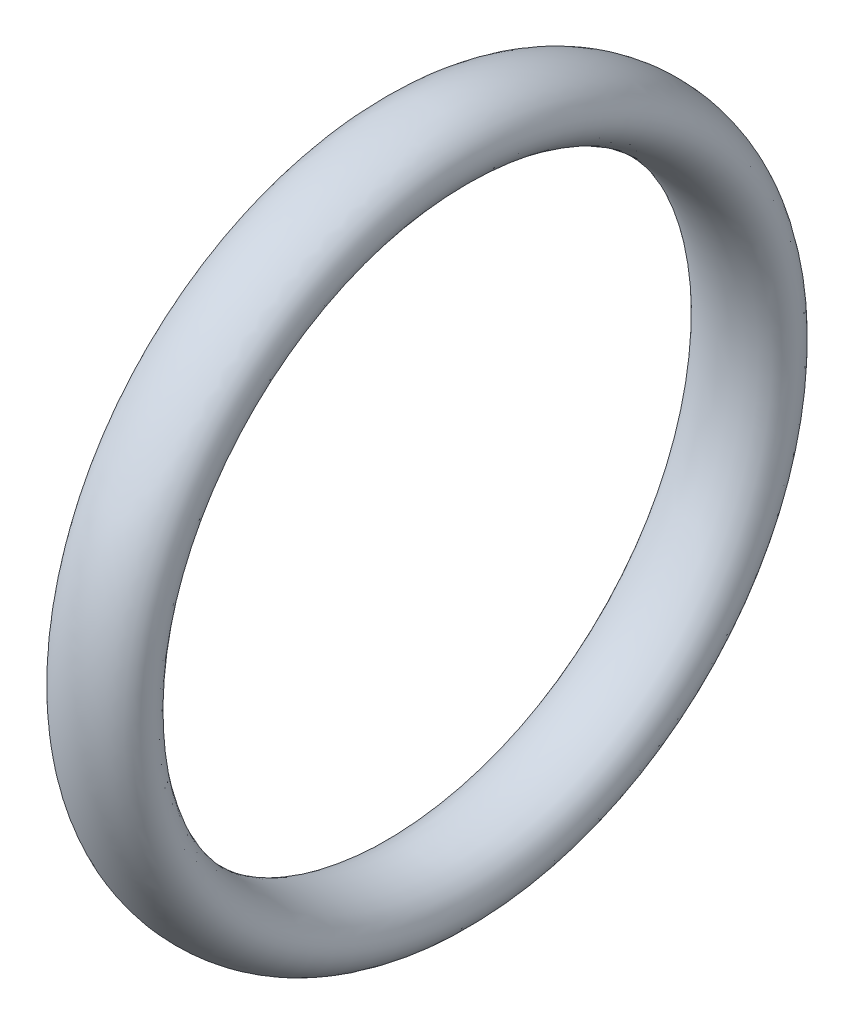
ISO-10303-21;
HEADER;
FILE_DESCRIPTION(('STEP AP214'),'2;1');
FILE_NAME('part.step','',(''),(''),'','','');
FILE_SCHEMA(('AUTOMOTIVE_DESIGN { 1 0 10303 214 1 1 1 1 }'));
ENDSEC;
DATA;
#1=APPLICATION_CONTEXT('core data for automotive mechanical design processes');
#2=APPLICATION_PROTOCOL_DEFINITION('international standard','automotive_design',2000,#1);
#3=PRODUCT_CONTEXT('',#1,'mechanical');
#4=PRODUCT('Part','Part','',(#3));
#5=PRODUCT_RELATED_PRODUCT_CATEGORY('part','',(#4));
#6=PRODUCT_DEFINITION_FORMATION('','',#4);
#7=PRODUCT_DEFINITION_CONTEXT('part definition',#1,'design');
#8=PRODUCT_DEFINITION('design','',#6,#7);
#9=PRODUCT_DEFINITION_SHAPE('','',#8);
#10=(LENGTH_UNIT() NAMED_UNIT(*) SI_UNIT(.MILLI.,.METRE.));
#11=(NAMED_UNIT(*) PLANE_ANGLE_UNIT() SI_UNIT($,.RADIAN.));
#12=(NAMED_UNIT(*) SI_UNIT($,.STERADIAN.) SOLID_ANGLE_UNIT());
#13=UNCERTAINTY_MEASURE_WITH_UNIT(LENGTH_MEASURE(1.E-05),#10,'distance_accuracy_value','');
#14=(GEOMETRIC_REPRESENTATION_CONTEXT(3) GLOBAL_UNCERTAINTY_ASSIGNED_CONTEXT((#13)) GLOBAL_UNIT_ASSIGNED_CONTEXT((#10,
#11,#12)) REPRESENTATION_CONTEXT('',''));
#15=CARTESIAN_POINT('',(0.,0.,0.));
#16=DIRECTION('',(0.,0.,1.));
#17=DIRECTION('',(1.,0.,0.));
#18=AXIS2_PLACEMENT_3D('',#15,#16,#17);
#19=CARTESIAN_POINT('',(0.,9.99999999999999,0.));
#20=DIRECTION('',(0.,0.,1.));
#21=DIRECTION('',(1.,0.,0.));
#22=AXIS2_PLACEMENT_3D('',#19,#20,#21);
#23=ELLIPSE('',#22,1.5,0.999999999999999);
#24=CARTESIAN_POINT('',(0.,0.,0.));
#25=DIRECTION('',(-1.,0.,0.));
#26=AXIS1_PLACEMENT('',#24,#25);
#27=SURFACE_OF_REVOLUTION('',#23,#26);
#28=ADVANCED_FACE('F27',(),#27,.T.);
#29=CLOSED_SHELL('',(#28));
#30=MANIFOLD_SOLID_BREP('B2',#29);
#31=ADVANCED_BREP_SHAPE_REPRESENTATION('',(#18,#30),#14);
#32=SHAPE_DEFINITION_REPRESENTATION(#9,#31);
ENDSEC;
END-ISO-10303-21;
